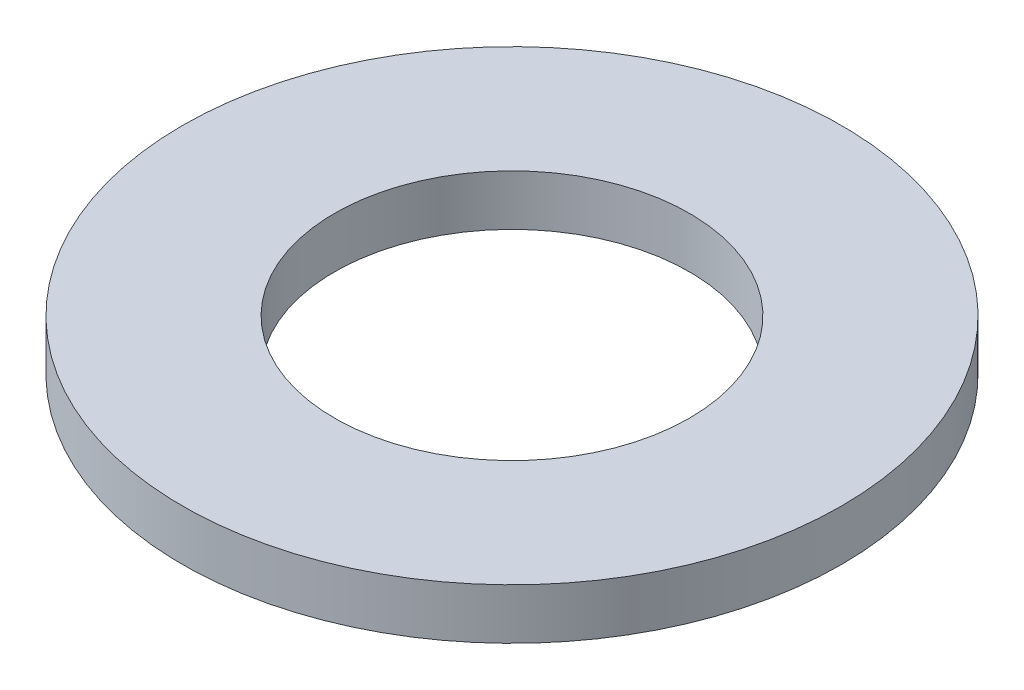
ISO-10303-21;
HEADER;
FILE_DESCRIPTION(('STEP AP214'),'2;1');
FILE_NAME('part.step','',(''),(''),'','','');
FILE_SCHEMA(('AUTOMOTIVE_DESIGN { 1 0 10303 214 1 1 1 1 }'));
ENDSEC;
DATA;
#1=APPLICATION_CONTEXT('core data for automotive mechanical design processes');
#2=APPLICATION_PROTOCOL_DEFINITION('international standard','automotive_design',2000,#1);
#3=PRODUCT_CONTEXT('',#1,'mechanical');
#4=PRODUCT('Part','Part','',(#3));
#5=PRODUCT_RELATED_PRODUCT_CATEGORY('part','',(#4));
#6=PRODUCT_DEFINITION_FORMATION('','',#4);
#7=PRODUCT_DEFINITION_CONTEXT('part definition',#1,'design');
#8=PRODUCT_DEFINITION('design','',#6,#7);
#9=PRODUCT_DEFINITION_SHAPE('','',#8);
#10=(LENGTH_UNIT() NAMED_UNIT(*) SI_UNIT(.MILLI.,.METRE.));
#11=(NAMED_UNIT(*) PLANE_ANGLE_UNIT() SI_UNIT($,.RADIAN.));
#12=(NAMED_UNIT(*) SI_UNIT($,.STERADIAN.) SOLID_ANGLE_UNIT());
#13=UNCERTAINTY_MEASURE_WITH_UNIT(LENGTH_MEASURE(1.E-05),#10,'distance_accuracy_value','');
#14=(GEOMETRIC_REPRESENTATION_CONTEXT(3) GLOBAL_UNCERTAINTY_ASSIGNED_CONTEXT((#13)) GLOBAL_UNIT_ASSIGNED_CONTEXT((#10,
#11,#12)) REPRESENTATION_CONTEXT('',''));
#15=CARTESIAN_POINT('',(0.,0.,0.));
#16=DIRECTION('',(0.,0.,1.));
#17=DIRECTION('',(1.,0.,0.));
#18=AXIS2_PLACEMENT_3D('',#15,#16,#17);
#19=CARTESIAN_POINT('',(0.,1.,0.));
#20=DIRECTION('',(0.,-1.,0.));
#21=DIRECTION('',(1.,0.,0.));
#22=AXIS2_PLACEMENT_3D('',#19,#20,#21);
#23=PLANE('',#22);
#24=CARTESIAN_POINT('',(0.,1.,0.));
#25=DIRECTION('',(0.,-1.,0.));
#26=DIRECTION('',(1.,0.,0.));
#27=AXIS2_PLACEMENT_3D('',#24,#25,#26);
#28=CIRCLE('',#27,6.5);
#29=CARTESIAN_POINT('',(6.5,1.,0.));
#30=VERTEX_POINT('',#29);
#31=EDGE_CURVE('E26',#30,#30,#28,.T.);
#32=ORIENTED_EDGE('',*,*,#31,.F.);
#33=EDGE_LOOP('',(#32));
#34=FACE_BOUND('',#33,.T.);
#35=CARTESIAN_POINT('',(0.,1.,0.));
#36=DIRECTION('',(0.,-1.,0.));
#37=DIRECTION('',(1.,0.,0.));
#38=AXIS2_PLACEMENT_3D('',#35,#36,#37);
#39=CIRCLE('',#38,3.5);
#40=CARTESIAN_POINT('',(3.5,1.,0.));
#41=VERTEX_POINT('',#40);
#42=EDGE_CURVE('E17',#41,#41,#39,.T.);
#43=ORIENTED_EDGE('',*,*,#42,.T.);
#44=EDGE_LOOP('',(#43));
#45=FACE_BOUND('',#44,.T.);
#46=ADVANCED_FACE('F14',(#34,#45),#23,.F.);
#47=CARTESIAN_POINT('',(0.,1.05,0.));
#48=DIRECTION('',(0.,-1.,0.));
#49=DIRECTION('',(1.,0.,0.));
#50=AXIS2_PLACEMENT_3D('',#47,#48,#49);
#51=CYLINDRICAL_SURFACE('',#50,3.5);
#52=ORIENTED_EDGE('',*,*,#42,.F.);
#53=EDGE_LOOP('',(#52));
#54=FACE_BOUND('',#53,.T.);
#55=CARTESIAN_POINT('',(0.,0.,0.));
#56=DIRECTION('',(0.,-1.,0.));
#57=DIRECTION('',(1.,0.,0.));
#58=AXIS2_PLACEMENT_3D('',#55,#56,#57);
#59=CIRCLE('',#58,3.5);
#60=CARTESIAN_POINT('',(3.5,0.,0.));
#61=VERTEX_POINT('',#60);
#62=EDGE_CURVE('E21',#61,#61,#59,.F.);
#63=ORIENTED_EDGE('',*,*,#62,.F.);
#64=EDGE_LOOP('',(#63));
#65=FACE_BOUND('',#64,.T.);
#66=ADVANCED_FACE('F35',(#54,#65),#51,.F.);
#67=CARTESIAN_POINT('',(0.,1.05,0.));
#68=DIRECTION('',(0.,-1.,0.));
#69=DIRECTION('',(1.,0.,0.));
#70=AXIS2_PLACEMENT_3D('',#67,#68,#69);
#71=CYLINDRICAL_SURFACE('',#70,6.5);
#72=ORIENTED_EDGE('',*,*,#31,.T.);
#73=EDGE_LOOP('',(#72));
#74=FACE_BOUND('',#73,.T.);
#75=CARTESIAN_POINT('',(0.,0.,0.));
#76=DIRECTION('',(0.,-1.,0.));
#77=DIRECTION('',(1.,0.,0.));
#78=AXIS2_PLACEMENT_3D('',#75,#76,#77);
#79=CIRCLE('',#78,6.5);
#80=CARTESIAN_POINT('',(6.5,0.,0.));
#81=VERTEX_POINT('',#80);
#82=EDGE_CURVE('E10',#81,#81,#79,.T.);
#83=ORIENTED_EDGE('',*,*,#82,.F.);
#84=EDGE_LOOP('',(#83));
#85=FACE_BOUND('',#84,.T.);
#86=ADVANCED_FACE('F38',(#74,#85),#71,.T.);
#87=CARTESIAN_POINT('',(0.,0.,0.));
#88=DIRECTION('',(0.,-1.,0.));
#89=DIRECTION('',(1.,0.,0.));
#90=AXIS2_PLACEMENT_3D('',#87,#88,#89);
#91=PLANE('',#90);
#92=ORIENTED_EDGE('',*,*,#82,.T.);
#93=EDGE_LOOP('',(#92));
#94=FACE_BOUND('',#93,.T.);
#95=ORIENTED_EDGE('',*,*,#62,.T.);
#96=EDGE_LOOP('',(#95));
#97=FACE_BOUND('',#96,.T.);
#98=ADVANCED_FACE('F41',(#94,#97),#91,.T.);
#99=CLOSED_SHELL('',(#46,#66,#86,#98));
#100=MANIFOLD_SOLID_BREP('B1',#99);
#101=ADVANCED_BREP_SHAPE_REPRESENTATION('',(#18,#100),#14);
#102=SHAPE_DEFINITION_REPRESENTATION(#9,#101);
ENDSEC;
END-ISO-10303-21;
